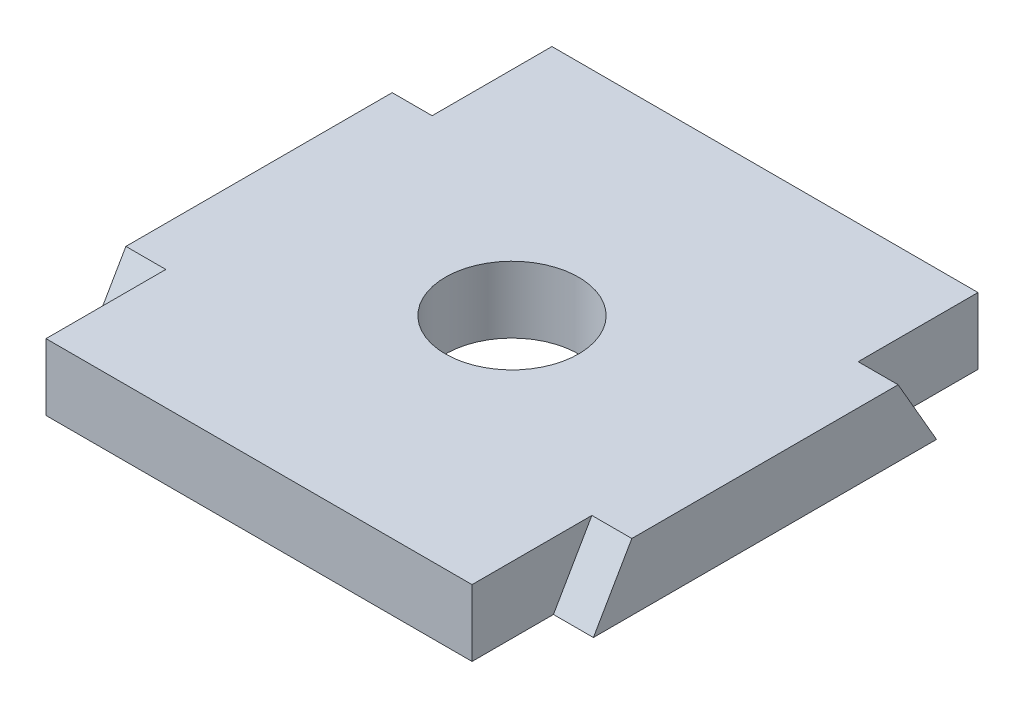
from build123d import *

# Parameters (mm, degrees)
SKETCH1_R      = 5
EXTRUDE1_DEPTH = 5
EXTRUDE2_DEPTH = 38


with BuildPart() as part:
    # Sketch1 → Extrude1 (new body)
    with BuildSketch(Plane(origin=(0, 0, 0), x_dir=(1, 0, 0), z_dir=(0, 1, 0))):
        Polygon((3, 0), (3, 9), (0, 9), (0, 29), (3, 29), (3, 38), (35, 38), (35, 29), (38, 29), (38, 9), (35, 9), (35, 0), align=None)
        with Locations(Location((19, 19, 0), (0, 0, 270))):
            Circle(SKETCH1_R, mode=Mode.SUBTRACT)
    extrude(amount=EXTRUDE1_DEPTH)

    # Sketch2 → Extrude2 (add)
    with BuildSketch(Plane(origin=(38, 0, 0), x_dir=(0, 0, -1), z_dir=(1, 0, 0))):
        Polygon((29, 5), (31.886751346, 0), (29, 0), align=None)
        Polygon((9, 5), (9, 0), (6.113248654, 0), align=None)
    extrude(amount=-EXTRUDE2_DEPTH)


solid = part.part
